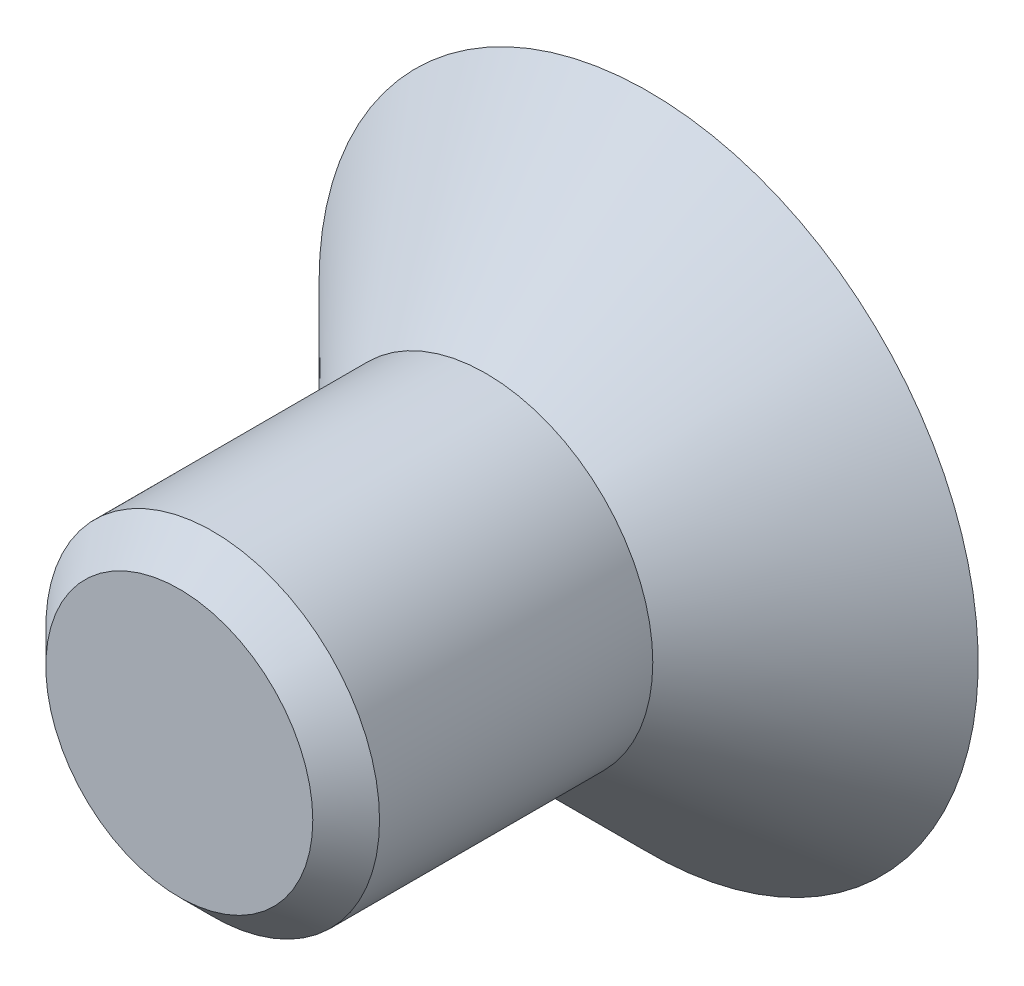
from build123d import *

# Parameters (mm, degrees)
FENTE1_DEPTH    = 3.8
ESQUISSE3_W     = 4
ESQUISSE3_H     = 7.35
CHANFREIN1_SIZE = 0.8


with BuildPart() as part:
    # Esquisse1 → Base-R_volution (revolve)
    with BuildSketch(Plane(origin=(0, 0, 0), x_dir=(1, 0, 0), z_dir=(0, 1, 0))):
        Polygon((4, 0), (7.9, 3.9), (0, 3.9), (0, 0), align=None)
    revolve(axis=Axis((0, 0, 0), (0, 0, -1)))

    # Esquisse2 → fente1 (cut)
    with BuildSketch(Plane.XY.offset(-3.9)):
        Polygon((2.5, -1.443375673), (2.5, 1.443375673), (0, 2.886751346), (-2.5, 1.443375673), (-2.5, -1.443375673), (0, -2.886751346), align=None)
    extrude(amount=FENTE1_DEPTH, mode=Mode.SUBTRACT)

    # Esquisse3 → Boss.-R_vol.1 (revolve)
    with BuildSketch(Plane(origin=(0, 0, 0), x_dir=(1, 0, 0), z_dir=(0, 1, 0))):
        with Locations((2, -3.675)):
            Rectangle(ESQUISSE3_W, ESQUISSE3_H)
    revolve(axis=Axis((0, 0, 0), (0, 0, 1)))

    # Chanfrein1
    chanfrein1_edges = [part.edges().sort_by_distance(p)[0] for p in [
        (-4, 0, 7.35),
    ]]
    chamfer(chanfrein1_edges, length=CHANFREIN1_SIZE)


solid = part.part
